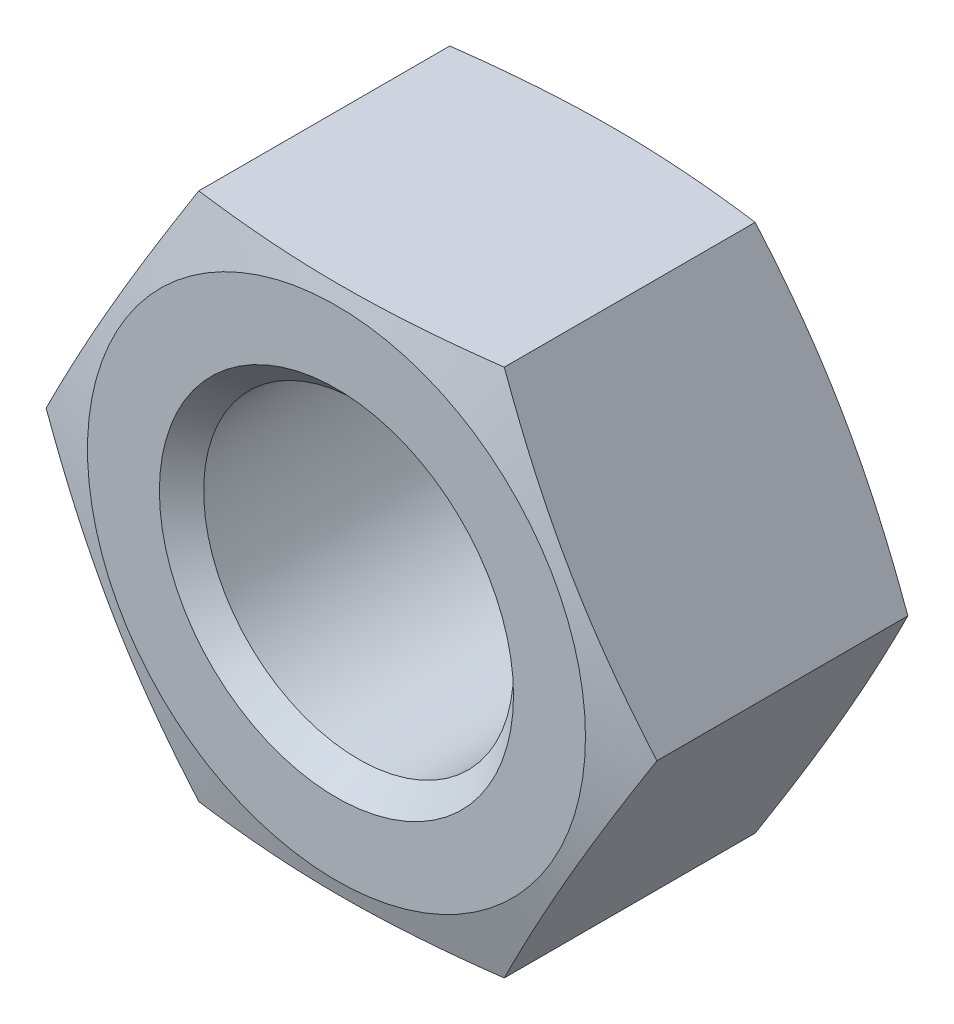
ISO-10303-21;
HEADER;
FILE_DESCRIPTION(('STEP AP214'),'2;1');
FILE_NAME('part.step','',(''),(''),'','','');
FILE_SCHEMA(('AUTOMOTIVE_DESIGN { 1 0 10303 214 1 1 1 1 }'));
ENDSEC;
DATA;
#1=APPLICATION_CONTEXT('core data for automotive mechanical design processes');
#2=APPLICATION_PROTOCOL_DEFINITION('international standard','automotive_design',2000,#1);
#3=PRODUCT_CONTEXT('',#1,'mechanical');
#4=PRODUCT('Part','Part','',(#3));
#5=PRODUCT_RELATED_PRODUCT_CATEGORY('part','',(#4));
#6=PRODUCT_DEFINITION_FORMATION('','',#4);
#7=PRODUCT_DEFINITION_CONTEXT('part definition',#1,'design');
#8=PRODUCT_DEFINITION('design','',#6,#7);
#9=PRODUCT_DEFINITION_SHAPE('','',#8);
#10=(LENGTH_UNIT() NAMED_UNIT(*) SI_UNIT(.MILLI.,.METRE.));
#11=(NAMED_UNIT(*) PLANE_ANGLE_UNIT() SI_UNIT($,.RADIAN.));
#12=(NAMED_UNIT(*) SI_UNIT($,.STERADIAN.) SOLID_ANGLE_UNIT());
#13=UNCERTAINTY_MEASURE_WITH_UNIT(LENGTH_MEASURE(1.E-05),#10,'distance_accuracy_value','');
#14=(GEOMETRIC_REPRESENTATION_CONTEXT(3) GLOBAL_UNCERTAINTY_ASSIGNED_CONTEXT((#13)) GLOBAL_UNIT_ASSIGNED_CONTEXT((#10,
#11,#12)) REPRESENTATION_CONTEXT('',''));
#15=CARTESIAN_POINT('',(0.,0.,0.));
#16=DIRECTION('',(0.,0.,1.));
#17=DIRECTION('',(1.,0.,0.));
#18=AXIS2_PLACEMENT_3D('',#15,#16,#17);
#19=CARTESIAN_POINT('',(-6.89933571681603,-11.95,6.35));
#20=DIRECTION('',(0.,1.,0.));
#21=DIRECTION('',(-1.,0.,0.));
#22=AXIS2_PLACEMENT_3D('',#19,#20,#21);
#23=PLANE('',#22);
#24=CARTESIAN_POINT('',(-18.4038265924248,-11.95,-3.48476992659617));
#25=CARTESIAN_POINT('',(-17.8595542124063,-11.95,-3.60705175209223));
#26=CARTESIAN_POINT('',(-17.3149453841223,-11.95,-3.72786248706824));
#27=CARTESIAN_POINT('',(-16.2248890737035,-11.95,-3.96574669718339));
#28=CARTESIAN_POINT('',(-15.6794415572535,-11.95,-4.0828200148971));
#29=CARTESIAN_POINT('',(-14.5870939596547,-11.95,-4.31252775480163));
#30=CARTESIAN_POINT('',(-14.0401930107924,-11.95,-4.42515806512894));
#31=CARTESIAN_POINT('',(-12.9452627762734,-11.95,-4.64479070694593));
#32=CARTESIAN_POINT('',(-12.3972334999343,-11.95,-4.75179308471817));
#33=CARTESIAN_POINT('',(-11.3049453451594,-11.95,-4.95786340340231));
#34=CARTESIAN_POINT('',(-10.7606986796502,-11.95,-5.05699576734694));
#35=CARTESIAN_POINT('',(-9.6707163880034,-11.95,-5.24677519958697));
#36=CARTESIAN_POINT('',(-9.12498075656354,-11.95,-5.33742223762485));
#37=CARTESIAN_POINT('',(-8.03190097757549,-11.95,-5.50822275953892));
#38=CARTESIAN_POINT('',(-7.48455696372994,-11.95,-5.58837709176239));
#39=CARTESIAN_POINT('',(-6.38812355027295,-11.95,-5.73585875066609));
#40=CARTESIAN_POINT('',(-5.83903414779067,-11.95,-5.80318605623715));
#41=CARTESIAN_POINT('',(-4.73278447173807,-11.95,-5.92315135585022));
#42=CARTESIAN_POINT('',(-4.17560445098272,-11.95,-5.97560993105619));
#43=CARTESIAN_POINT('',(-3.05981190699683,-11.95,-6.06223176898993));
#44=CARTESIAN_POINT('',(-2.50119941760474,-11.95,-6.09639545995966));
#45=CARTESIAN_POINT('',(-1.3833877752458,-11.95,-6.1444379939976));
#46=CARTESIAN_POINT('',(-0.824189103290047,-11.95,-6.15832780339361));
#47=CARTESIAN_POINT('',(0.294335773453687,-11.95,-6.16496976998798));
#48=CARTESIAN_POINT('',(0.853661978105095,-11.95,-6.1577219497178));
#49=CARTESIAN_POINT('',(1.97435005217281,-11.95,-6.12247317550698));
#50=CARTESIAN_POINT('',(2.53570871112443,-11.95,-6.09437218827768));
#51=CARTESIAN_POINT('',(3.65712625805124,-11.95,-6.01900843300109));
#52=CARTESIAN_POINT('',(4.21718511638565,-11.95,-5.97174523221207));
#53=CARTESIAN_POINT('',(5.33603429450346,-11.95,-5.86048247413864));
#54=CARTESIAN_POINT('',(5.8948233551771,-11.95,-5.7964704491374));
#55=CARTESIAN_POINT('',(7.01058859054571,-11.95,-5.65442236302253));
#56=CARTESIAN_POINT('',(7.56756477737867,-11.95,-5.57638639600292));
#57=CARTESIAN_POINT('',(8.83709082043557,-11.95,-5.3851527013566));
#58=CARTESIAN_POINT('',(9.54907919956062,-11.95,-5.26825295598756));
#59=CARTESIAN_POINT('',(10.9705735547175,-11.95,-5.02013562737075));
#60=CARTESIAN_POINT('',(11.6800793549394,-11.95,-4.88891705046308));
#61=CARTESIAN_POINT('',(13.0971625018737,-11.95,-4.61562892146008));
#62=CARTESIAN_POINT('',(13.8047393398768,-11.95,-4.47355674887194));
#63=CARTESIAN_POINT('',(15.2181660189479,-11.95,-4.18119780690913));
#64=CARTESIAN_POINT('',(15.9240159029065,-11.95,-4.03091124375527));
#65=CARTESIAN_POINT('',(17.3348173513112,-11.95,-3.7239295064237));
#66=CARTESIAN_POINT('',(18.0397679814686,-11.95,-3.56723005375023));
#67=CARTESIAN_POINT('',(19.4485617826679,-11.95,-3.24892730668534));
#68=CARTESIAN_POINT('',(20.1524049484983,-11.95,-3.0873239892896));
#69=CARTESIAN_POINT('',(21.5590916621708,-11.95,-2.7602841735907));
#70=CARTESIAN_POINT('',(22.2619353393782,-11.95,-2.59484823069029));
#71=CARTESIAN_POINT('',(23.666888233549,-11.95,-2.26089721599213));
#72=CARTESIAN_POINT('',(24.3689974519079,-11.95,-2.09238215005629));
#73=CARTESIAN_POINT('',(26.4503551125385,-11.95,-1.58896361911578));
#74=CARTESIAN_POINT('',(27.8287496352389,-11.95,-1.25053129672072));
#75=CARTESIAN_POINT('',(30.583999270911,-11.95,-0.567230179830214));
#76=CARTESIAN_POINT('',(31.9608543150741,-11.95,-0.222361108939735));
#77=CARTESIAN_POINT('',(34.7106309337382,-11.95,0.471225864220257));
#78=CARTESIAN_POINT('',(36.0835548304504,-11.95,0.819934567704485));
#79=CARTESIAN_POINT('',(38.1422692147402,-11.95,1.3454713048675));
#80=CARTESIAN_POINT('',(38.8283772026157,-11.95,1.52105779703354));
#81=CARTESIAN_POINT('',(40.2004075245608,-11.95,1.87295279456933));
#82=CARTESIAN_POINT('',(40.8863298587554,-11.95,2.04926129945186));
#83=CARTESIAN_POINT('',(41.572172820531,-11.95,2.22587814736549));
#84=B_SPLINE_CURVE_WITH_KNOTS('',3,(#24,#25,#26,#27,#28,#29,#30,#31,#32,#33,#34,#35,#36,#37,#38,
#39,#40,#41,#42,#43,#44,#45,#46,#47,#48,#49,#50,#51,#52,#53,#54,#55,#56,#57,#58,#59,#60,#61,#62,
#63,#64,#65,#66,#67,#68,#69,#70,#71,#72,#73,#74,#75,#76,#77,#78,#79,#80,#81,#82,#83),
.UNSPECIFIED.,.F.,.F.,(4,2,2,2,2,2,2,2,2,2,2,2,2,2,2,2,2,2,2,2,2,2,2,2,2,2,2,2,2,4),(0.,
1.67352610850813,3.34712261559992,5.02223328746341,6.69733018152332,8.35688039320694,
10.0164365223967,11.675858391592,13.3352829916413,15.0139531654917,16.6925840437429,
18.3703065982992,20.0480273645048,21.7338486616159,23.4197080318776,25.1068259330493,
26.7939325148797,28.9582911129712,31.1228000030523,33.2878331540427,35.4528119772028,
37.6192595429,39.7857172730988,41.9518629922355,44.1180045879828,48.3759786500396,
52.63413597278,56.8836780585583,59.0083361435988,61.1329927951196),.UNSPECIFIED.);
#85=CARTESIAN_POINT('',(6.89933571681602,-11.95,-5.66708554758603));
#86=VERTEX_POINT('',#85);
#87=CARTESIAN_POINT('',(-6.89933571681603,-11.95,-5.66708554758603));
#88=VERTEX_POINT('',#87);
#89=EDGE_CURVE('E54',#86,#88,#84,.F.);
#90=ORIENTED_EDGE('',*,*,#89,.F.);
#91=DIRECTION('',(0.,0.,-1.));
#92=VECTOR('',#91,1.);
#93=CARTESIAN_POINT('',(6.89933571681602,-11.95,6.35));
#94=LINE('',#93,#92);
#95=CARTESIAN_POINT('',(6.89933571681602,-11.95,5.66708554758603));
#96=VERTEX_POINT('',#95);
#97=EDGE_CURVE('E124',#96,#86,#94,.T.);
#98=ORIENTED_EDGE('',*,*,#97,.F.);
#99=CARTESIAN_POINT('',(-18.4038265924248,-11.95,3.48476992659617));
#100=CARTESIAN_POINT('',(-17.8595542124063,-11.95,3.60705175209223));
#101=CARTESIAN_POINT('',(-17.3149453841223,-11.95,3.72786248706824));
#102=CARTESIAN_POINT('',(-16.2248890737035,-11.95,3.96574669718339));
#103=CARTESIAN_POINT('',(-15.6794415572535,-11.95,4.0828200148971));
#104=CARTESIAN_POINT('',(-14.5870939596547,-11.95,4.31252775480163));
#105=CARTESIAN_POINT('',(-14.0401930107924,-11.95,4.42515806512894));
#106=CARTESIAN_POINT('',(-12.9452627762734,-11.95,4.64479070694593));
#107=CARTESIAN_POINT('',(-12.3972334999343,-11.95,4.75179308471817));
#108=CARTESIAN_POINT('',(-11.3049453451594,-11.95,4.95786340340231));
#109=CARTESIAN_POINT('',(-10.7606986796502,-11.95,5.05699576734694));
#110=CARTESIAN_POINT('',(-9.6707163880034,-11.95,5.24677519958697));
#111=CARTESIAN_POINT('',(-9.12498075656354,-11.95,5.33742223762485));
#112=CARTESIAN_POINT('',(-8.03190097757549,-11.95,5.50822275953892));
#113=CARTESIAN_POINT('',(-7.48455696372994,-11.95,5.58837709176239));
#114=CARTESIAN_POINT('',(-6.38812355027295,-11.95,5.73585875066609));
#115=CARTESIAN_POINT('',(-5.83903414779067,-11.95,5.80318605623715));
#116=CARTESIAN_POINT('',(-4.73278447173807,-11.95,5.92315135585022));
#117=CARTESIAN_POINT('',(-4.17560445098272,-11.95,5.97560993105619));
#118=CARTESIAN_POINT('',(-3.05981190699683,-11.95,6.06223176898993));
#119=CARTESIAN_POINT('',(-2.50119941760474,-11.95,6.09639545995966));
#120=CARTESIAN_POINT('',(-1.3833877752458,-11.95,6.1444379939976));
#121=CARTESIAN_POINT('',(-0.824189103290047,-11.95,6.15832780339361));
#122=CARTESIAN_POINT('',(0.294335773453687,-11.95,6.16496976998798));
#123=CARTESIAN_POINT('',(0.853661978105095,-11.95,6.1577219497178));
#124=CARTESIAN_POINT('',(1.97435005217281,-11.95,6.12247317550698));
#125=CARTESIAN_POINT('',(2.53570871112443,-11.95,6.09437218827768));
#126=CARTESIAN_POINT('',(3.65712625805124,-11.95,6.01900843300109));
#127=CARTESIAN_POINT('',(4.21718511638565,-11.95,5.97174523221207));
#128=CARTESIAN_POINT('',(5.33603429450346,-11.95,5.86048247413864));
#129=CARTESIAN_POINT('',(5.8948233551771,-11.95,5.7964704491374));
#130=CARTESIAN_POINT('',(7.01058859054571,-11.95,5.65442236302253));
#131=CARTESIAN_POINT('',(7.56756477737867,-11.95,5.57638639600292));
#132=CARTESIAN_POINT('',(8.83709082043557,-11.95,5.3851527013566));
#133=CARTESIAN_POINT('',(9.54907919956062,-11.95,5.26825295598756));
#134=CARTESIAN_POINT('',(10.9705735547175,-11.95,5.02013562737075));
#135=CARTESIAN_POINT('',(11.6800793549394,-11.95,4.88891705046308));
#136=CARTESIAN_POINT('',(13.0971625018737,-11.95,4.61562892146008));
#137=CARTESIAN_POINT('',(13.8047393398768,-11.95,4.47355674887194));
#138=CARTESIAN_POINT('',(15.2181660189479,-11.95,4.18119780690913));
#139=CARTESIAN_POINT('',(15.9240159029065,-11.95,4.03091124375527));
#140=CARTESIAN_POINT('',(17.3348173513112,-11.95,3.7239295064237));
#141=CARTESIAN_POINT('',(18.0397679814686,-11.95,3.56723005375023));
#142=CARTESIAN_POINT('',(19.4485617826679,-11.95,3.24892730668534));
#143=CARTESIAN_POINT('',(20.1524049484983,-11.95,3.0873239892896));
#144=CARTESIAN_POINT('',(21.5590916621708,-11.95,2.7602841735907));
#145=CARTESIAN_POINT('',(22.2619353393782,-11.95,2.59484823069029));
#146=CARTESIAN_POINT('',(23.666888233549,-11.95,2.26089721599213));
#147=CARTESIAN_POINT('',(24.3689974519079,-11.95,2.09238215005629));
#148=CARTESIAN_POINT('',(26.4503551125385,-11.95,1.58896361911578));
#149=CARTESIAN_POINT('',(27.8287496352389,-11.95,1.25053129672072));
#150=CARTESIAN_POINT('',(30.583999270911,-11.95,0.567230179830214));
#151=CARTESIAN_POINT('',(31.9608543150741,-11.95,0.222361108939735));
#152=CARTESIAN_POINT('',(34.7106309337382,-11.95,-0.471225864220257));
#153=CARTESIAN_POINT('',(36.0835548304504,-11.95,-0.819934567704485));
#154=CARTESIAN_POINT('',(38.1422692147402,-11.95,-1.3454713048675));
#155=CARTESIAN_POINT('',(38.8283772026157,-11.95,-1.52105779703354));
#156=CARTESIAN_POINT('',(40.2004075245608,-11.95,-1.87295279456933));
#157=CARTESIAN_POINT('',(40.8863298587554,-11.95,-2.04926129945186));
#158=CARTESIAN_POINT('',(41.572172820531,-11.95,-2.22587814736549));
#159=B_SPLINE_CURVE_WITH_KNOTS('',3,(#99,#100,#101,#102,#103,#104,#105,#106,#107,#108,#109,#110,
#111,#112,#113,#114,#115,#116,#117,#118,#119,#120,#121,#122,#123,#124,#125,#126,#127,#128,#129,
#130,#131,#132,#133,#134,#135,#136,#137,#138,#139,#140,#141,#142,#143,#144,#145,#146,#147,#148,
#149,#150,#151,#152,#153,#154,#155,#156,#157,#158),.UNSPECIFIED.,.F.,.F.,(4,2,2,2,2,2,2,2,2,2,2,
2,2,2,2,2,2,2,2,2,2,2,2,2,2,2,2,2,2,4),(0.,1.67352610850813,3.34712261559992,5.02223328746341,
6.69733018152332,8.35688039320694,10.0164365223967,11.675858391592,13.3352829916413,
15.0139531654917,16.6925840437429,18.3703065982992,20.0480273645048,21.7338486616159,
23.4197080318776,25.1068259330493,26.7939325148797,28.9582911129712,31.1228000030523,
33.2878331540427,35.4528119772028,37.6192595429,39.7857172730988,41.9518629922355,
44.1180045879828,48.3759786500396,52.63413597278,56.8836780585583,59.0083361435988,
61.1329927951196),.UNSPECIFIED.);
#160=CARTESIAN_POINT('',(-6.89933571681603,-11.95,5.66708554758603));
#161=VERTEX_POINT('',#160);
#162=EDGE_CURVE('E115',#161,#96,#159,.T.);
#163=ORIENTED_EDGE('',*,*,#162,.F.);
#164=DIRECTION('',(0.,0.,-1.));
#165=VECTOR('',#164,1.);
#166=CARTESIAN_POINT('',(-6.89933571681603,-11.95,6.35));
#167=LINE('',#166,#165);
#168=EDGE_CURVE('E111',#161,#88,#167,.T.);
#169=ORIENTED_EDGE('',*,*,#168,.T.);
#170=EDGE_LOOP('',(#90,#98,#163,#169));
#171=FACE_BOUND('',#170,.T.);
#172=ADVANCED_FACE('F39',(#171),#23,.F.);
#173=CARTESIAN_POINT('',(6.89933571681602,-11.95,6.35));
#174=DIRECTION('',(-0.866025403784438,0.5,0.));
#175=DIRECTION('',(-0.5,-0.866025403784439,0.));
#176=AXIS2_PLACEMENT_3D('',#173,#174,#175);
#177=PLANE('',#176);
#178=CARTESIAN_POINT('',(13.7987869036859,0.000199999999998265,-5.66705460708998));
#179=CARTESIAN_POINT('',(13.5122652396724,-0.496070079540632,-5.74385883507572));
#180=CARTESIAN_POINT('',(13.2252240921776,-0.993239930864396,-5.81358430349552));
#181=CARTESIAN_POINT('',(12.6501281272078,-1.98933536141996,-5.93608529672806));
#182=CARTESIAN_POINT('',(12.3620729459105,-2.48826157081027,-5.98885393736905));
#183=CARTESIAN_POINT('',(11.7866953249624,-3.4848448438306,-6.07436078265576));
#184=CARTESIAN_POINT('',(11.4993767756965,-3.98249516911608,-6.10720095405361));
#185=CARTESIAN_POINT('',(10.9243732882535,-4.97843042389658,-6.15123625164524));
#186=CARTESIAN_POINT('',(10.6366884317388,-5.47671521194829,-6.16243556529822));
#187=CARTESIAN_POINT('',(10.0613187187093,-6.47328478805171,-6.16243556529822));
#188=CARTESIAN_POINT('',(9.77363386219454,-6.97156957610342,-6.15123625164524));
#189=CARTESIAN_POINT('',(9.19863037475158,-7.96750483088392,-6.10720095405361));
#190=CARTESIAN_POINT('',(8.9113118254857,-8.4651551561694,-6.07436078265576));
#191=CARTESIAN_POINT('',(8.33593420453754,-9.46173842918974,-5.98885393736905));
#192=CARTESIAN_POINT('',(8.04787902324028,-9.96066463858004,-5.93608529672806));
#193=CARTESIAN_POINT('',(7.47278305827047,-10.9567600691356,-5.81358430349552));
#194=CARTESIAN_POINT('',(7.18574191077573,-11.4539299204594,-5.74385883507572));
#195=CARTESIAN_POINT('',(6.89922024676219,-11.9502,-5.66705460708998));
#196=B_SPLINE_CURVE_WITH_KNOTS('',3,(#178,#179,#180,#181,#182,#183,#184,#185,#186,#187,#188,
#189,#190,#191,#192,#193,#194,#195),.UNSPECIFIED.,.F.,.F.,(4,2,2,2,2,2,2,2,4),(0.,
1.73459307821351,3.46988948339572,5.19623045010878,6.92223734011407,8.64824423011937,
10.3745851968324,12.1098816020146,13.8444746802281),.UNSPECIFIED.);
#197=CARTESIAN_POINT('',(13.7986714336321,0.,-5.66708554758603));
#198=VERTEX_POINT('',#197);
#199=EDGE_CURVE('E199',#198,#86,#196,.T.);
#200=ORIENTED_EDGE('',*,*,#199,.F.);
#201=DIRECTION('',(0.,0.,-1.));
#202=VECTOR('',#201,1.);
#203=CARTESIAN_POINT('',(13.7986714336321,0.,6.35));
#204=LINE('',#203,#202);
#205=CARTESIAN_POINT('',(13.7986714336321,0.,5.66708554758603));
#206=VERTEX_POINT('',#205);
#207=EDGE_CURVE('E121',#206,#198,#204,.T.);
#208=ORIENTED_EDGE('',*,*,#207,.F.);
#209=CARTESIAN_POINT('',(6.89922024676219,-11.9502,5.66705460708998));
#210=CARTESIAN_POINT('',(7.18574191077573,-11.4539299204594,5.74385883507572));
#211=CARTESIAN_POINT('',(7.47278305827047,-10.9567600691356,5.81358430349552));
#212=CARTESIAN_POINT('',(8.04787902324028,-9.96066463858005,5.93608529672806));
#213=CARTESIAN_POINT('',(8.33593420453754,-9.46173842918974,5.98885393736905));
#214=CARTESIAN_POINT('',(8.9113118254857,-8.4651551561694,6.07436078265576));
#215=CARTESIAN_POINT('',(9.19863037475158,-7.96750483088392,6.10720095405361));
#216=CARTESIAN_POINT('',(9.77363386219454,-6.97156957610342,6.15123625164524));
#217=CARTESIAN_POINT('',(10.0613187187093,-6.47328478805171,6.16243556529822));
#218=CARTESIAN_POINT('',(10.6366884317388,-5.47671521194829,6.16243556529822));
#219=CARTESIAN_POINT('',(10.9243732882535,-4.97843042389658,6.15123625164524));
#220=CARTESIAN_POINT('',(11.4993767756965,-3.98249516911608,6.10720095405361));
#221=CARTESIAN_POINT('',(11.7866953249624,-3.4848448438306,6.07436078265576));
#222=CARTESIAN_POINT('',(12.3620729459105,-2.48826157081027,5.98885393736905));
#223=CARTESIAN_POINT('',(12.6501281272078,-1.98933536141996,5.93608529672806));
#224=CARTESIAN_POINT('',(13.2252240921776,-0.993239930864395,5.81358430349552));
#225=CARTESIAN_POINT('',(13.5122652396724,-0.49607007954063,5.74385883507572));
#226=CARTESIAN_POINT('',(13.7987869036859,0.00019999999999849,5.66705460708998));
#227=B_SPLINE_CURVE_WITH_KNOTS('',3,(#209,#210,#211,#212,#213,#214,#215,#216,#217,#218,#219,
#220,#221,#222,#223,#224,#225,#226),.UNSPECIFIED.,.F.,.F.,(4,2,2,2,2,2,2,2,4),(0.,
1.7345930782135,3.46988948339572,5.19623045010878,6.92223734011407,8.64824423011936,
10.3745851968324,12.1098816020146,13.8444746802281),.UNSPECIFIED.);
#228=EDGE_CURVE('E220',#96,#206,#227,.T.);
#229=ORIENTED_EDGE('',*,*,#228,.F.);
#230=ORIENTED_EDGE('',*,*,#97,.T.);
#231=EDGE_LOOP('',(#200,#208,#229,#230));
#232=FACE_BOUND('',#231,.T.);
#233=ADVANCED_FACE('F208',(#232),#177,.F.);
#234=CARTESIAN_POINT('',(13.7986714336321,0.,6.35));
#235=DIRECTION('',(-0.866025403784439,-0.5,0.));
#236=DIRECTION('',(0.5,-0.866025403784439,0.));
#237=AXIS2_PLACEMENT_3D('',#234,#235,#236);
#238=PLANE('',#237);
#239=CARTESIAN_POINT('',(6.89922024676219,11.9502,-5.66705460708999));
#240=CARTESIAN_POINT('',(7.18574191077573,11.4539299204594,-5.74385883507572));
#241=CARTESIAN_POINT('',(7.47278305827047,10.9567600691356,-5.81358430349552));
#242=CARTESIAN_POINT('',(8.04787902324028,9.96066463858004,-5.93608529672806));
#243=CARTESIAN_POINT('',(8.33593420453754,9.46173842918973,-5.98885393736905));
#244=CARTESIAN_POINT('',(8.9113118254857,8.4651551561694,-6.07436078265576));
#245=CARTESIAN_POINT('',(9.19863037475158,7.96750483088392,-6.10720095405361));
#246=CARTESIAN_POINT('',(9.77363386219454,6.97156957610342,-6.15123625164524));
#247=CARTESIAN_POINT('',(10.0613187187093,6.47328478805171,-6.16243556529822));
#248=CARTESIAN_POINT('',(10.6366884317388,5.47671521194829,-6.16243556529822));
#249=CARTESIAN_POINT('',(10.9243732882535,4.97843042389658,-6.15123625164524));
#250=CARTESIAN_POINT('',(11.4993767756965,3.98249516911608,-6.10720095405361));
#251=CARTESIAN_POINT('',(11.7866953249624,3.4848448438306,-6.07436078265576));
#252=CARTESIAN_POINT('',(12.3620729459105,2.48826157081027,-5.98885393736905));
#253=CARTESIAN_POINT('',(12.6501281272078,1.98933536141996,-5.93608529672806));
#254=CARTESIAN_POINT('',(13.2252240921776,0.993239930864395,-5.81358430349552));
#255=CARTESIAN_POINT('',(13.5122652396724,0.496070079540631,-5.74385883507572));
#256=CARTESIAN_POINT('',(13.7987869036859,-0.000199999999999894,-5.66705460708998));
#257=B_SPLINE_CURVE_WITH_KNOTS('',3,(#239,#240,#241,#242,#243,#244,#245,#246,#247,#248,#249,
#250,#251,#252,#253,#254,#255,#256),.UNSPECIFIED.,.F.,.F.,(4,2,2,2,2,2,2,2,4),(0.,
1.73459307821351,3.46988948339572,5.19623045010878,6.92223734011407,8.64824423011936,
10.3745851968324,12.1098816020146,13.8444746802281),.UNSPECIFIED.);
#258=CARTESIAN_POINT('',(6.89933571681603,11.95,-5.66708554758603));
#259=VERTEX_POINT('',#258);
#260=EDGE_CURVE('E194',#259,#198,#257,.T.);
#261=ORIENTED_EDGE('',*,*,#260,.F.);
#262=DIRECTION('',(0.,0.,-1.));
#263=VECTOR('',#262,1.);
#264=CARTESIAN_POINT('',(6.89933571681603,11.95,6.35));
#265=LINE('',#264,#263);
#266=CARTESIAN_POINT('',(6.89933571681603,11.95,5.66708554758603));
#267=VERTEX_POINT('',#266);
#268=EDGE_CURVE('E113',#267,#259,#265,.T.);
#269=ORIENTED_EDGE('',*,*,#268,.F.);
#270=CARTESIAN_POINT('',(13.7987869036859,-0.000200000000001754,5.66705460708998));
#271=CARTESIAN_POINT('',(13.5122652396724,0.496070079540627,5.74385883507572));
#272=CARTESIAN_POINT('',(13.2252240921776,0.993239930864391,5.81358430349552));
#273=CARTESIAN_POINT('',(12.6501281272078,1.98933536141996,5.93608529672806));
#274=CARTESIAN_POINT('',(12.3620729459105,2.48826157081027,5.98885393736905));
#275=CARTESIAN_POINT('',(11.7866953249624,3.4848448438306,6.07436078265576));
#276=CARTESIAN_POINT('',(11.4993767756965,3.98249516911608,6.10720095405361));
#277=CARTESIAN_POINT('',(10.9243732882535,4.97843042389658,6.15123625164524));
#278=CARTESIAN_POINT('',(10.6366884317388,5.47671521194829,6.16243556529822));
#279=CARTESIAN_POINT('',(10.0613187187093,6.47328478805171,6.16243556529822));
#280=CARTESIAN_POINT('',(9.77363386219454,6.97156957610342,6.15123625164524));
#281=CARTESIAN_POINT('',(9.19863037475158,7.96750483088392,6.10720095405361));
#282=CARTESIAN_POINT('',(8.9113118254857,8.4651551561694,6.07436078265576));
#283=CARTESIAN_POINT('',(8.33593420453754,9.46173842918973,5.98885393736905));
#284=CARTESIAN_POINT('',(8.04787902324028,9.96066463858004,5.93608529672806));
#285=CARTESIAN_POINT('',(7.47278305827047,10.9567600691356,5.81358430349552));
#286=CARTESIAN_POINT('',(7.18574191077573,11.4539299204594,5.74385883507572));
#287=CARTESIAN_POINT('',(6.89922024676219,11.9502,5.66705460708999));
#288=B_SPLINE_CURVE_WITH_KNOTS('',3,(#270,#271,#272,#273,#274,#275,#276,#277,#278,#279,#280,
#281,#282,#283,#284,#285,#286,#287),.UNSPECIFIED.,.F.,.F.,(4,2,2,2,2,2,2,2,4),(0.,
1.7345930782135,3.46988948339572,5.19623045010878,6.92223734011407,8.64824423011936,
10.3745851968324,12.1098816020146,13.8444746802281),.UNSPECIFIED.);
#289=EDGE_CURVE('E214',#206,#267,#288,.T.);
#290=ORIENTED_EDGE('',*,*,#289,.F.);
#291=ORIENTED_EDGE('',*,*,#207,.T.);
#292=EDGE_LOOP('',(#261,#269,#290,#291));
#293=FACE_BOUND('',#292,.T.);
#294=ADVANCED_FACE('F204',(#293),#238,.F.);
#295=CARTESIAN_POINT('',(6.89933571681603,11.95,6.35));
#296=DIRECTION('',(0.,-1.,0.));
#297=DIRECTION('',(0.,0.,-1.));
#298=AXIS2_PLACEMENT_3D('',#295,#296,#297);
#299=PLANE('',#298);
#300=CARTESIAN_POINT('',(-18.4038265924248,11.95,-3.48476992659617));
#301=CARTESIAN_POINT('',(-17.8595542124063,11.95,-3.60705175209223));
#302=CARTESIAN_POINT('',(-17.3149453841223,11.95,-3.72786248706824));
#303=CARTESIAN_POINT('',(-16.2248890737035,11.95,-3.96574669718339));
#304=CARTESIAN_POINT('',(-15.6794415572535,11.95,-4.0828200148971));
#305=CARTESIAN_POINT('',(-14.5870939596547,11.95,-4.31252775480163));
#306=CARTESIAN_POINT('',(-14.0401930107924,11.95,-4.42515806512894));
#307=CARTESIAN_POINT('',(-12.9452627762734,11.95,-4.64479070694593));
#308=CARTESIAN_POINT('',(-12.3972334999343,11.95,-4.75179308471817));
#309=CARTESIAN_POINT('',(-11.3049453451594,11.95,-4.95786340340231));
#310=CARTESIAN_POINT('',(-10.7606986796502,11.95,-5.05699576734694));
#311=CARTESIAN_POINT('',(-9.6707163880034,11.95,-5.24677519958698));
#312=CARTESIAN_POINT('',(-9.12498075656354,11.95,-5.33742223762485));
#313=CARTESIAN_POINT('',(-8.03190097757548,11.95,-5.50822275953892));
#314=CARTESIAN_POINT('',(-7.48455696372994,11.95,-5.58837709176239));
#315=CARTESIAN_POINT('',(-6.38812355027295,11.95,-5.73585875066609));
#316=CARTESIAN_POINT('',(-5.83903414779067,11.95,-5.80318605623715));
#317=CARTESIAN_POINT('',(-4.73278447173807,11.95,-5.92315135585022));
#318=CARTESIAN_POINT('',(-4.17560445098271,11.95,-5.97560993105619));
#319=CARTESIAN_POINT('',(-3.05981190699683,11.95,-6.06223176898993));
#320=CARTESIAN_POINT('',(-2.50119941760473,11.95,-6.09639545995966));
#321=CARTESIAN_POINT('',(-1.38338777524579,11.95,-6.1444379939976));
#322=CARTESIAN_POINT('',(-0.824189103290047,11.95,-6.15832780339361));
#323=CARTESIAN_POINT('',(0.294335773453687,11.95,-6.16496976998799));
#324=CARTESIAN_POINT('',(0.853661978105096,11.95,-6.1577219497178));
#325=CARTESIAN_POINT('',(1.97435005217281,11.95,-6.12247317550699));
#326=CARTESIAN_POINT('',(2.53570871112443,11.95,-6.09437218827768));
#327=CARTESIAN_POINT('',(3.65712625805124,11.95,-6.01900843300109));
#328=CARTESIAN_POINT('',(4.21718511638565,11.95,-5.97174523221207));
#329=CARTESIAN_POINT('',(5.33603429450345,11.95,-5.86048247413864));
#330=CARTESIAN_POINT('',(5.8948233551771,11.95,-5.79647044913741));
#331=CARTESIAN_POINT('',(7.01058859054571,11.95,-5.65442236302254));
#332=CARTESIAN_POINT('',(7.56756477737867,11.95,-5.57638639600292));
#333=CARTESIAN_POINT('',(8.83709082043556,11.95,-5.3851527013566));
#334=CARTESIAN_POINT('',(9.54907919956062,11.95,-5.26825295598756));
#335=CARTESIAN_POINT('',(10.9705735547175,11.95,-5.02013562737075));
#336=CARTESIAN_POINT('',(11.6800793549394,11.95,-4.88891705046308));
#337=CARTESIAN_POINT('',(13.0971625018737,11.95,-4.61562892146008));
#338=CARTESIAN_POINT('',(13.8047393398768,11.95,-4.47355674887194));
#339=CARTESIAN_POINT('',(15.2181660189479,11.95,-4.18119780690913));
#340=CARTESIAN_POINT('',(15.9240159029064,11.95,-4.03091124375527));
#341=CARTESIAN_POINT('',(17.3348173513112,11.95,-3.7239295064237));
#342=CARTESIAN_POINT('',(18.0397679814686,11.95,-3.56723005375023));
#343=CARTESIAN_POINT('',(19.4485617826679,11.95,-3.24892730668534));
#344=CARTESIAN_POINT('',(20.1524049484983,11.95,-3.0873239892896));
#345=CARTESIAN_POINT('',(21.5590916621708,11.95,-2.7602841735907));
#346=CARTESIAN_POINT('',(22.2619353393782,11.95,-2.59484823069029));
#347=CARTESIAN_POINT('',(23.6668882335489,11.95,-2.26089721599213));
#348=CARTESIAN_POINT('',(24.3689974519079,11.95,-2.09238215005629));
#349=CARTESIAN_POINT('',(26.4503551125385,11.95,-1.58896361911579));
#350=CARTESIAN_POINT('',(27.8287496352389,11.95,-1.25053129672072));
#351=CARTESIAN_POINT('',(30.583999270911,11.95,-0.567230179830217));
#352=CARTESIAN_POINT('',(31.9608543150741,11.95,-0.222361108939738));
#353=CARTESIAN_POINT('',(34.7106309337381,11.95,0.471225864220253));
#354=CARTESIAN_POINT('',(36.0835548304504,11.95,0.819934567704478));
#355=CARTESIAN_POINT('',(38.1422692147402,11.95,1.3454713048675));
#356=CARTESIAN_POINT('',(38.8283772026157,11.95,1.52105779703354));
#357=CARTESIAN_POINT('',(40.2004075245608,11.95,1.87295279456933));
#358=CARTESIAN_POINT('',(40.8863298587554,11.95,2.04926129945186));
#359=CARTESIAN_POINT('',(41.572172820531,11.95,2.22587814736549));
#360=B_SPLINE_CURVE_WITH_KNOTS('',3,(#300,#301,#302,#303,#304,#305,#306,#307,#308,#309,#310,
#311,#312,#313,#314,#315,#316,#317,#318,#319,#320,#321,#322,#323,#324,#325,#326,#327,#328,#329,
#330,#331,#332,#333,#334,#335,#336,#337,#338,#339,#340,#341,#342,#343,#344,#345,#346,#347,#348,
#349,#350,#351,#352,#353,#354,#355,#356,#357,#358,#359),.UNSPECIFIED.,.F.,.F.,(4,2,2,2,2,2,2,2,
2,2,2,2,2,2,2,2,2,2,2,2,2,2,2,2,2,2,2,2,2,4),(0.,1.67352610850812,3.34712261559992,
5.0222332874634,6.69733018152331,8.35688039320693,10.0164365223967,11.675858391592,
13.3352829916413,15.0139531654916,16.6925840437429,18.3703065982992,20.0480273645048,
21.7338486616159,23.4197080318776,25.1068259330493,26.7939325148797,28.9582911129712,
31.1228000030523,33.2878331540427,35.4528119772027,37.6192595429,39.7857172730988,
41.9518629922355,44.1180045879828,48.3759786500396,52.63413597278,56.8836780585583,
59.0083361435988,61.1329927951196),.UNSPECIFIED.);
#361=CARTESIAN_POINT('',(-6.89933571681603,11.95,-5.66708554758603));
#362=VERTEX_POINT('',#361);
#363=EDGE_CURVE('E107',#362,#259,#360,.T.);
#364=ORIENTED_EDGE('',*,*,#363,.F.);
#365=DIRECTION('',(0.,0.,-1.));
#366=VECTOR('',#365,1.);
#367=CARTESIAN_POINT('',(-6.89933571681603,11.95,6.35));
#368=LINE('',#367,#366);
#369=CARTESIAN_POINT('',(-6.89933571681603,11.95,5.66708554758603));
#370=VERTEX_POINT('',#369);
#371=EDGE_CURVE('E106',#370,#362,#368,.T.);
#372=ORIENTED_EDGE('',*,*,#371,.F.);
#373=CARTESIAN_POINT('',(-18.4038265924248,11.95,3.48476992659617));
#374=CARTESIAN_POINT('',(-17.8595542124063,11.95,3.60705175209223));
#375=CARTESIAN_POINT('',(-17.3149453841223,11.95,3.72786248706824));
#376=CARTESIAN_POINT('',(-16.2248890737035,11.95,3.96574669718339));
#377=CARTESIAN_POINT('',(-15.6794415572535,11.95,4.0828200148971));
#378=CARTESIAN_POINT('',(-14.5870939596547,11.95,4.31252775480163));
#379=CARTESIAN_POINT('',(-14.0401930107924,11.95,4.42515806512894));
#380=CARTESIAN_POINT('',(-12.9452627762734,11.95,4.64479070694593));
#381=CARTESIAN_POINT('',(-12.3972334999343,11.95,4.75179308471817));
#382=CARTESIAN_POINT('',(-11.3049453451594,11.95,4.95786340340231));
#383=CARTESIAN_POINT('',(-10.7606986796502,11.95,5.05699576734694));
#384=CARTESIAN_POINT('',(-9.6707163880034,11.95,5.24677519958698));
#385=CARTESIAN_POINT('',(-9.12498075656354,11.95,5.33742223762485));
#386=CARTESIAN_POINT('',(-8.03190097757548,11.95,5.50822275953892));
#387=CARTESIAN_POINT('',(-7.48455696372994,11.95,5.58837709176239));
#388=CARTESIAN_POINT('',(-6.38812355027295,11.95,5.73585875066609));
#389=CARTESIAN_POINT('',(-5.83903414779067,11.95,5.80318605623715));
#390=CARTESIAN_POINT('',(-4.73278447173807,11.95,5.92315135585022));
#391=CARTESIAN_POINT('',(-4.17560445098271,11.95,5.97560993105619));
#392=CARTESIAN_POINT('',(-3.05981190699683,11.95,6.06223176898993));
#393=CARTESIAN_POINT('',(-2.50119941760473,11.95,6.09639545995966));
#394=CARTESIAN_POINT('',(-1.38338777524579,11.95,6.1444379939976));
#395=CARTESIAN_POINT('',(-0.824189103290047,11.95,6.15832780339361));
#396=CARTESIAN_POINT('',(0.294335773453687,11.95,6.16496976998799));
#397=CARTESIAN_POINT('',(0.853661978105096,11.95,6.1577219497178));
#398=CARTESIAN_POINT('',(1.97435005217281,11.95,6.12247317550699));
#399=CARTESIAN_POINT('',(2.53570871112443,11.95,6.09437218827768));
#400=CARTESIAN_POINT('',(3.65712625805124,11.95,6.01900843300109));
#401=CARTESIAN_POINT('',(4.21718511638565,11.95,5.97174523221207));
#402=CARTESIAN_POINT('',(5.33603429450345,11.95,5.86048247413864));
#403=CARTESIAN_POINT('',(5.8948233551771,11.95,5.79647044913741));
#404=CARTESIAN_POINT('',(7.01058859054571,11.95,5.65442236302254));
#405=CARTESIAN_POINT('',(7.56756477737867,11.95,5.57638639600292));
#406=CARTESIAN_POINT('',(8.83709082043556,11.95,5.3851527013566));
#407=CARTESIAN_POINT('',(9.54907919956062,11.95,5.26825295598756));
#408=CARTESIAN_POINT('',(10.9705735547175,11.95,5.02013562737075));
#409=CARTESIAN_POINT('',(11.6800793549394,11.95,4.88891705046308));
#410=CARTESIAN_POINT('',(13.0971625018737,11.95,4.61562892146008));
#411=CARTESIAN_POINT('',(13.8047393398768,11.95,4.47355674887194));
#412=CARTESIAN_POINT('',(15.2181660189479,11.95,4.18119780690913));
#413=CARTESIAN_POINT('',(15.9240159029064,11.95,4.03091124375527));
#414=CARTESIAN_POINT('',(17.3348173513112,11.95,3.7239295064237));
#415=CARTESIAN_POINT('',(18.0397679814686,11.95,3.56723005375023));
#416=CARTESIAN_POINT('',(19.4485617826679,11.95,3.24892730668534));
#417=CARTESIAN_POINT('',(20.1524049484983,11.95,3.0873239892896));
#418=CARTESIAN_POINT('',(21.5590916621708,11.95,2.7602841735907));
#419=CARTESIAN_POINT('',(22.2619353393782,11.95,2.59484823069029));
#420=CARTESIAN_POINT('',(23.6668882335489,11.95,2.26089721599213));
#421=CARTESIAN_POINT('',(24.3689974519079,11.95,2.09238215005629));
#422=CARTESIAN_POINT('',(26.4503551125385,11.95,1.58896361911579));
#423=CARTESIAN_POINT('',(27.8287496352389,11.95,1.25053129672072));
#424=CARTESIAN_POINT('',(30.583999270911,11.95,0.567230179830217));
#425=CARTESIAN_POINT('',(31.9608543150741,11.95,0.222361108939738));
#426=CARTESIAN_POINT('',(34.7106309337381,11.95,-0.471225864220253));
#427=CARTESIAN_POINT('',(36.0835548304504,11.95,-0.819934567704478));
#428=CARTESIAN_POINT('',(38.1422692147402,11.95,-1.3454713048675));
#429=CARTESIAN_POINT('',(38.8283772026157,11.95,-1.52105779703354));
#430=CARTESIAN_POINT('',(40.2004075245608,11.95,-1.87295279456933));
#431=CARTESIAN_POINT('',(40.8863298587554,11.95,-2.04926129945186));
#432=CARTESIAN_POINT('',(41.572172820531,11.95,-2.22587814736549));
#433=B_SPLINE_CURVE_WITH_KNOTS('',3,(#373,#374,#375,#376,#377,#378,#379,#380,#381,#382,#383,
#384,#385,#386,#387,#388,#389,#390,#391,#392,#393,#394,#395,#396,#397,#398,#399,#400,#401,#402,
#403,#404,#405,#406,#407,#408,#409,#410,#411,#412,#413,#414,#415,#416,#417,#418,#419,#420,#421,
#422,#423,#424,#425,#426,#427,#428,#429,#430,#431,#432),.UNSPECIFIED.,.F.,.F.,(4,2,2,2,2,2,2,2,
2,2,2,2,2,2,2,2,2,2,2,2,2,2,2,2,2,2,2,2,2,4),(0.,1.67352610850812,3.34712261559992,
5.0222332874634,6.69733018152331,8.35688039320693,10.0164365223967,11.675858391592,
13.3352829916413,15.0139531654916,16.6925840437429,18.3703065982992,20.0480273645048,
21.7338486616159,23.4197080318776,25.1068259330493,26.7939325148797,28.9582911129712,
31.1228000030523,33.2878331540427,35.4528119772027,37.6192595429,39.7857172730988,
41.9518629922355,44.1180045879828,48.3759786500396,52.63413597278,56.8836780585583,
59.0083361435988,61.1329927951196),.UNSPECIFIED.);
#434=EDGE_CURVE('E221',#267,#370,#433,.F.);
#435=ORIENTED_EDGE('',*,*,#434,.F.);
#436=ORIENTED_EDGE('',*,*,#268,.T.);
#437=EDGE_LOOP('',(#364,#372,#435,#436));
#438=FACE_BOUND('',#437,.T.);
#439=ADVANCED_FACE('F207',(#438),#299,.F.);
#440=CARTESIAN_POINT('',(-6.89933571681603,11.95,6.35));
#441=DIRECTION('',(0.866025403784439,-0.5,0.));
#442=DIRECTION('',(0.5,0.866025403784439,0.));
#443=AXIS2_PLACEMENT_3D('',#440,#441,#442);
#444=PLANE('',#443);
#445=CARTESIAN_POINT('',(-13.7987869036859,-0.0002,-5.66705460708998));
#446=CARTESIAN_POINT('',(-13.5122652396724,0.496070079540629,-5.74385883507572));
#447=CARTESIAN_POINT('',(-13.2252240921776,0.993239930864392,-5.81358430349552));
#448=CARTESIAN_POINT('',(-12.6501281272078,1.98933536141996,-5.93608529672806));
#449=CARTESIAN_POINT('',(-12.3620729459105,2.48826157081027,-5.98885393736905));
#450=CARTESIAN_POINT('',(-11.7866953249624,3.4848448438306,-6.07436078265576));
#451=CARTESIAN_POINT('',(-11.4993767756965,3.98249516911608,-6.10720095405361));
#452=CARTESIAN_POINT('',(-10.9243732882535,4.97843042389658,-6.15123625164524));
#453=CARTESIAN_POINT('',(-10.6366884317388,5.47671521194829,-6.16243556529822));
#454=CARTESIAN_POINT('',(-10.0613187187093,6.47328478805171,-6.16243556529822));
#455=CARTESIAN_POINT('',(-9.77363386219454,6.97156957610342,-6.15123625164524));
#456=CARTESIAN_POINT('',(-9.19863037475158,7.96750483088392,-6.10720095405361));
#457=CARTESIAN_POINT('',(-8.91131182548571,8.4651551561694,-6.07436078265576));
#458=CARTESIAN_POINT('',(-8.33593420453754,9.46173842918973,-5.98885393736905));
#459=CARTESIAN_POINT('',(-8.04787902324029,9.96066463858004,-5.93608529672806));
#460=CARTESIAN_POINT('',(-7.47278305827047,10.9567600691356,-5.81358430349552));
#461=CARTESIAN_POINT('',(-7.18574191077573,11.4539299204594,-5.74385883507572));
#462=CARTESIAN_POINT('',(-6.89922024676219,11.9502,-5.66705460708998));
#463=B_SPLINE_CURVE_WITH_KNOTS('',3,(#445,#446,#447,#448,#449,#450,#451,#452,#453,#454,#455,
#456,#457,#458,#459,#460,#461,#462),.UNSPECIFIED.,.F.,.F.,(4,2,2,2,2,2,2,2,4),(0.,
1.7345930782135,3.46988948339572,5.19623045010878,6.92223734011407,8.64824423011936,
10.3745851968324,12.1098816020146,13.8444746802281),.UNSPECIFIED.);
#464=CARTESIAN_POINT('',(-13.7986714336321,0.,-5.66708554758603));
#465=VERTEX_POINT('',#464);
#466=EDGE_CURVE('E92',#465,#362,#463,.T.);
#467=ORIENTED_EDGE('',*,*,#466,.F.);
#468=DIRECTION('',(0.,0.,-1.));
#469=VECTOR('',#468,1.);
#470=CARTESIAN_POINT('',(-13.7986714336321,0.,6.35));
#471=LINE('',#470,#469);
#472=CARTESIAN_POINT('',(-13.7986714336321,0.,5.66708554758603));
#473=VERTEX_POINT('',#472);
#474=EDGE_CURVE('E104',#473,#465,#471,.T.);
#475=ORIENTED_EDGE('',*,*,#474,.F.);
#476=CARTESIAN_POINT('',(-6.89922024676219,11.9502,5.66705460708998));
#477=CARTESIAN_POINT('',(-7.18574191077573,11.4539299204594,5.74385883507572));
#478=CARTESIAN_POINT('',(-7.47278305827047,10.9567600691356,5.81358430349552));
#479=CARTESIAN_POINT('',(-8.04787902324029,9.96066463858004,5.93608529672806));
#480=CARTESIAN_POINT('',(-8.33593420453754,9.46173842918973,5.98885393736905));
#481=CARTESIAN_POINT('',(-8.91131182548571,8.4651551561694,6.07436078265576));
#482=CARTESIAN_POINT('',(-9.19863037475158,7.96750483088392,6.10720095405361));
#483=CARTESIAN_POINT('',(-9.77363386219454,6.97156957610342,6.15123625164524));
#484=CARTESIAN_POINT('',(-10.0613187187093,6.47328478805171,6.16243556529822));
#485=CARTESIAN_POINT('',(-10.6366884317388,5.47671521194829,6.16243556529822));
#486=CARTESIAN_POINT('',(-10.9243732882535,4.97843042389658,6.15123625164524));
#487=CARTESIAN_POINT('',(-11.4993767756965,3.98249516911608,6.10720095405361));
#488=CARTESIAN_POINT('',(-11.7866953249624,3.4848448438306,6.07436078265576));
#489=CARTESIAN_POINT('',(-12.3620729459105,2.48826157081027,5.98885393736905));
#490=CARTESIAN_POINT('',(-12.6501281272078,1.98933536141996,5.93608529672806));
#491=CARTESIAN_POINT('',(-13.2252240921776,0.993239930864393,5.81358430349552));
#492=CARTESIAN_POINT('',(-13.5122652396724,0.49607007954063,5.74385883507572));
#493=CARTESIAN_POINT('',(-13.7987869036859,-0.000200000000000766,5.66705460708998));
#494=B_SPLINE_CURVE_WITH_KNOTS('',3,(#476,#477,#478,#479,#480,#481,#482,#483,#484,#485,#486,
#487,#488,#489,#490,#491,#492,#493),.UNSPECIFIED.,.F.,.F.,(4,2,2,2,2,2,2,2,4),(0.,
1.73459307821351,3.46988948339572,5.19623045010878,6.92223734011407,8.64824423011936,
10.3745851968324,12.1098816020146,13.8444746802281),.UNSPECIFIED.);
#495=EDGE_CURVE('E62',#370,#473,#494,.T.);
#496=ORIENTED_EDGE('',*,*,#495,.F.);
#497=ORIENTED_EDGE('',*,*,#371,.T.);
#498=EDGE_LOOP('',(#467,#475,#496,#497));
#499=FACE_BOUND('',#498,.T.);
#500=ADVANCED_FACE('F103',(#499),#444,.F.);
#501=CARTESIAN_POINT('',(-13.7986714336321,0.,6.35));
#502=DIRECTION('',(0.866025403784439,0.5,0.));
#503=DIRECTION('',(-0.5,0.866025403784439,0.));
#504=AXIS2_PLACEMENT_3D('',#501,#502,#503);
#505=PLANE('',#504);
#506=CARTESIAN_POINT('',(-6.89922024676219,-11.9502,-5.66705460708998));
#507=CARTESIAN_POINT('',(-7.18574191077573,-11.4539299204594,-5.74385883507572));
#508=CARTESIAN_POINT('',(-7.47278305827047,-10.9567600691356,-5.81358430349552));
#509=CARTESIAN_POINT('',(-8.04787902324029,-9.96066463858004,-5.93608529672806));
#510=CARTESIAN_POINT('',(-8.33593420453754,-9.46173842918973,-5.98885393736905));
#511=CARTESIAN_POINT('',(-8.91131182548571,-8.4651551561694,-6.07436078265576));
#512=CARTESIAN_POINT('',(-9.19863037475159,-7.96750483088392,-6.10720095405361));
#513=CARTESIAN_POINT('',(-9.77363386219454,-6.97156957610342,-6.15123625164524));
#514=CARTESIAN_POINT('',(-10.0613187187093,-6.47328478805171,-6.16243556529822));
#515=CARTESIAN_POINT('',(-10.6366884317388,-5.47671521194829,-6.16243556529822));
#516=CARTESIAN_POINT('',(-10.9243732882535,-4.97843042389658,-6.15123625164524));
#517=CARTESIAN_POINT('',(-11.4993767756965,-3.98249516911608,-6.10720095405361));
#518=CARTESIAN_POINT('',(-11.7866953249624,-3.4848448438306,-6.07436078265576));
#519=CARTESIAN_POINT('',(-12.3620729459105,-2.48826157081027,-5.98885393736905));
#520=CARTESIAN_POINT('',(-12.6501281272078,-1.98933536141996,-5.93608529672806));
#521=CARTESIAN_POINT('',(-13.2252240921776,-0.993239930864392,-5.81358430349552));
#522=CARTESIAN_POINT('',(-13.5122652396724,-0.496070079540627,-5.74385883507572));
#523=CARTESIAN_POINT('',(-13.7987869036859,0.000200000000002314,-5.66705460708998));
#524=B_SPLINE_CURVE_WITH_KNOTS('',3,(#506,#507,#508,#509,#510,#511,#512,#513,#514,#515,#516,
#517,#518,#519,#520,#521,#522,#523),.UNSPECIFIED.,.F.,.F.,(4,2,2,2,2,2,2,2,4),(0.,
1.7345930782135,3.46988948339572,5.19623045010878,6.92223734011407,8.64824423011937,
10.3745851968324,12.1098816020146,13.8444746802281),.UNSPECIFIED.);
#525=EDGE_CURVE('E89',#88,#465,#524,.T.);
#526=ORIENTED_EDGE('',*,*,#525,.F.);
#527=ORIENTED_EDGE('',*,*,#168,.F.);
#528=CARTESIAN_POINT('',(-13.7987869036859,0.000200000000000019,5.66705460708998));
#529=CARTESIAN_POINT('',(-13.5122652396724,-0.496070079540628,5.74385883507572));
#530=CARTESIAN_POINT('',(-13.2252240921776,-0.993239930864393,5.81358430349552));
#531=CARTESIAN_POINT('',(-12.6501281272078,-1.98933536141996,5.93608529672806));
#532=CARTESIAN_POINT('',(-12.3620729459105,-2.48826157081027,5.98885393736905));
#533=CARTESIAN_POINT('',(-11.7866953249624,-3.4848448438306,6.07436078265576));
#534=CARTESIAN_POINT('',(-11.4993767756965,-3.98249516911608,6.10720095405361));
#535=CARTESIAN_POINT('',(-10.9243732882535,-4.97843042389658,6.15123625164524));
#536=CARTESIAN_POINT('',(-10.6366884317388,-5.47671521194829,6.16243556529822));
#537=CARTESIAN_POINT('',(-10.0613187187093,-6.47328478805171,6.16243556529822));
#538=CARTESIAN_POINT('',(-9.77363386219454,-6.97156957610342,6.15123625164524));
#539=CARTESIAN_POINT('',(-9.19863037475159,-7.96750483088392,6.10720095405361));
#540=CARTESIAN_POINT('',(-8.91131182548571,-8.4651551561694,6.07436078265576));
#541=CARTESIAN_POINT('',(-8.33593420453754,-9.46173842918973,5.98885393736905));
#542=CARTESIAN_POINT('',(-8.04787902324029,-9.96066463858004,5.93608529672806));
#543=CARTESIAN_POINT('',(-7.47278305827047,-10.9567600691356,5.81358430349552));
#544=CARTESIAN_POINT('',(-7.18574191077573,-11.4539299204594,5.74385883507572));
#545=CARTESIAN_POINT('',(-6.89922024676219,-11.9502,5.66705460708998));
#546=B_SPLINE_CURVE_WITH_KNOTS('',3,(#528,#529,#530,#531,#532,#533,#534,#535,#536,#537,#538,
#539,#540,#541,#542,#543,#544,#545),.UNSPECIFIED.,.F.,.F.,(4,2,2,2,2,2,2,2,4),(0.,
1.7345930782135,3.46988948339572,5.19623045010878,6.92223734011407,8.64824423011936,
10.3745851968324,12.1098816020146,13.8444746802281),.UNSPECIFIED.);
#547=EDGE_CURVE('E110',#473,#161,#546,.T.);
#548=ORIENTED_EDGE('',*,*,#547,.F.);
#549=ORIENTED_EDGE('',*,*,#474,.T.);
#550=EDGE_LOOP('',(#526,#527,#548,#549));
#551=FACE_BOUND('',#550,.T.);
#552=ADVANCED_FACE('F109',(#551),#505,.F.);
#553=CARTESIAN_POINT('',(0.,0.,-6.35));
#554=DIRECTION('',(0.,0.,1.));
#555=DIRECTION('',(1.,0.,0.));
#556=AXIS2_PLACEMENT_3D('',#553,#554,#555);
#557=PLANE('',#556);
#558=CARTESIAN_POINT('',(0.,0.,-6.35));
#559=DIRECTION('',(0.,0.,1.));
#560=DIRECTION('',(1.,0.,0.));
#561=AXIS2_PLACEMENT_3D('',#558,#559,#560);
#562=CIRCLE('',#561,7.99999999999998);
#563=CARTESIAN_POINT('',(7.99999999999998,0.,-6.35));
#564=VERTEX_POINT('',#563);
#565=EDGE_CURVE('E12',#564,#564,#562,.T.);
#566=ORIENTED_EDGE('',*,*,#565,.T.);
#567=EDGE_LOOP('',(#566));
#568=FACE_BOUND('',#567,.T.);
#569=CARTESIAN_POINT('',(0.,0.,-6.35));
#570=DIRECTION('',(0.,0.,-1.));
#571=DIRECTION('',(-1.,0.,0.));
#572=AXIS2_PLACEMENT_3D('',#569,#570,#571);
#573=CIRCLE('',#572,11.25);
#574=CARTESIAN_POINT('',(-11.25,0.,-6.35));
#575=VERTEX_POINT('',#574);
#576=EDGE_CURVE('E98',#575,#575,#573,.T.);
#577=ORIENTED_EDGE('',*,*,#576,.T.);
#578=EDGE_LOOP('',(#577));
#579=FACE_BOUND('',#578,.T.);
#580=ADVANCED_FACE('F154',(#568,#579),#557,.F.);
#581=CARTESIAN_POINT('',(0.,0.,6.35));
#582=DIRECTION('',(0.,0.,1.));
#583=DIRECTION('',(1.,0.,0.));
#584=AXIS2_PLACEMENT_3D('',#581,#582,#583);
#585=PLANE('',#584);
#586=CARTESIAN_POINT('',(0.,0.,6.35));
#587=DIRECTION('',(0.,0.,1.));
#588=DIRECTION('',(1.,0.,0.));
#589=AXIS2_PLACEMENT_3D('',#586,#587,#588);
#590=CIRCLE('',#589,8.);
#591=CARTESIAN_POINT('',(8.,0.,6.35));
#592=VERTEX_POINT('',#591);
#593=EDGE_CURVE('E47',#592,#592,#590,.F.);
#594=ORIENTED_EDGE('',*,*,#593,.T.);
#595=EDGE_LOOP('',(#594));
#596=FACE_BOUND('',#595,.T.);
#597=CARTESIAN_POINT('',(0.,0.,6.35));
#598=DIRECTION('',(0.,0.,1.));
#599=DIRECTION('',(1.,0.,0.));
#600=AXIS2_PLACEMENT_3D('',#597,#598,#599);
#601=CIRCLE('',#600,11.25);
#602=CARTESIAN_POINT('',(11.25,0.,6.35));
#603=VERTEX_POINT('',#602);
#604=EDGE_CURVE('E242',#603,#603,#601,.T.);
#605=ORIENTED_EDGE('',*,*,#604,.T.);
#606=EDGE_LOOP('',(#605));
#607=FACE_BOUND('',#606,.T.);
#608=ADVANCED_FACE('F135',(#596,#607),#585,.T.);
#609=CARTESIAN_POINT('',(0.,0.,6.35));
#610=DIRECTION('',(0.,0.,1.));
#611=DIRECTION('',(1.,0.,0.));
#612=AXIS2_PLACEMENT_3D('',#609,#610,#611);
#613=CYLINDRICAL_SURFACE('',#612,6.99999999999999);
#614=CARTESIAN_POINT('',(0.,0.,5.35));
#615=DIRECTION('',(0.,0.,1.));
#616=DIRECTION('',(1.,0.,0.));
#617=AXIS2_PLACEMENT_3D('',#614,#615,#616);
#618=CIRCLE('',#617,6.99999999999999);
#619=CARTESIAN_POINT('',(6.99999999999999,0.,5.35));
#620=VERTEX_POINT('',#619);
#621=EDGE_CURVE('E130',#620,#620,#618,.T.);
#622=ORIENTED_EDGE('',*,*,#621,.T.);
#623=EDGE_LOOP('',(#622));
#624=FACE_BOUND('',#623,.T.);
#625=CARTESIAN_POINT('',(0.,0.,-5.35));
#626=DIRECTION('',(0.,0.,1.));
#627=DIRECTION('',(1.,0.,0.));
#628=AXIS2_PLACEMENT_3D('',#625,#626,#627);
#629=CIRCLE('',#628,6.99999999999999);
#630=CARTESIAN_POINT('',(6.99999999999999,0.,-5.35));
#631=VERTEX_POINT('',#630);
#632=EDGE_CURVE('E127',#631,#631,#629,.F.);
#633=ORIENTED_EDGE('',*,*,#632,.T.);
#634=EDGE_LOOP('',(#633));
#635=FACE_BOUND('',#634,.T.);
#636=ADVANCED_FACE('F143',(#624,#635),#613,.F.);
#637=CARTESIAN_POINT('',(0.,0.,6.35));
#638=DIRECTION('',(0.,0.,-1.));
#639=DIRECTION('',(1.,0.,0.));
#640=AXIS2_PLACEMENT_3D('',#637,#638,#639);
#641=CONICAL_SURFACE('',#640,11.25,1.30899693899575);
#642=ORIENTED_EDGE('',*,*,#604,.F.);
#643=EDGE_LOOP('',(#642));
#644=FACE_BOUND('',#643,.T.);
#645=ORIENTED_EDGE('',*,*,#162,.T.);
#646=ORIENTED_EDGE('',*,*,#228,.T.);
#647=ORIENTED_EDGE('',*,*,#289,.T.);
#648=ORIENTED_EDGE('',*,*,#434,.T.);
#649=ORIENTED_EDGE('',*,*,#495,.T.);
#650=ORIENTED_EDGE('',*,*,#547,.T.);
#651=EDGE_LOOP('',(#645,#646,#647,#648,#649,#650));
#652=FACE_BOUND('',#651,.T.);
#653=ADVANCED_FACE('F146',(#644,#652),#641,.T.);
#654=CARTESIAN_POINT('',(0.,0.,-6.35));
#655=DIRECTION('',(0.,0.,1.));
#656=DIRECTION('',(-1.,0.,0.));
#657=AXIS2_PLACEMENT_3D('',#654,#655,#656);
#658=CONICAL_SURFACE('',#657,11.25,1.30899693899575);
#659=ORIENTED_EDGE('',*,*,#576,.F.);
#660=EDGE_LOOP('',(#659));
#661=FACE_BOUND('',#660,.T.);
#662=ORIENTED_EDGE('',*,*,#89,.T.);
#663=ORIENTED_EDGE('',*,*,#525,.T.);
#664=ORIENTED_EDGE('',*,*,#466,.T.);
#665=ORIENTED_EDGE('',*,*,#363,.T.);
#666=ORIENTED_EDGE('',*,*,#260,.T.);
#667=ORIENTED_EDGE('',*,*,#199,.T.);
#668=EDGE_LOOP('',(#662,#663,#664,#665,#666,#667));
#669=FACE_BOUND('',#668,.T.);
#670=ADVANCED_FACE('F91',(#661,#669),#658,.T.);
#671=CARTESIAN_POINT('',(0.,0.,5.35));
#672=DIRECTION('',(0.,0.,1.));
#673=DIRECTION('',(1.,0.,0.));
#674=AXIS2_PLACEMENT_3D('',#671,#672,#673);
#675=CONICAL_SURFACE('',#674,6.99999999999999,0.785398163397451);
#676=ORIENTED_EDGE('',*,*,#593,.F.);
#677=EDGE_LOOP('',(#676));
#678=FACE_BOUND('',#677,.T.);
#679=ORIENTED_EDGE('',*,*,#621,.F.);
#680=EDGE_LOOP('',(#679));
#681=FACE_BOUND('',#680,.T.);
#682=ADVANCED_FACE('F138',(#678,#681),#675,.F.);
#683=CARTESIAN_POINT('',(0.,0.,-6.35));
#684=DIRECTION('',(0.,0.,-1.));
#685=DIRECTION('',(-1.,0.,0.));
#686=AXIS2_PLACEMENT_3D('',#683,#684,#685);
#687=CONICAL_SURFACE('',#686,7.99999999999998,0.785398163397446);
#688=ORIENTED_EDGE('',*,*,#632,.F.);
#689=EDGE_LOOP('',(#688));
#690=FACE_BOUND('',#689,.T.);
#691=ORIENTED_EDGE('',*,*,#565,.F.);
#692=EDGE_LOOP('',(#691));
#693=FACE_BOUND('',#692,.T.);
#694=ADVANCED_FACE('F41',(#690,#693),#687,.F.);
#695=CLOSED_SHELL('',(#172,#233,#294,#439,#500,#552,#580,#608,#636,#653,#670,#682,#694));
#696=MANIFOLD_SOLID_BREP('B2',#695);
#697=ADVANCED_BREP_SHAPE_REPRESENTATION('',(#18,#696),#14);
#698=SHAPE_DEFINITION_REPRESENTATION(#9,#697);
ENDSEC;
END-ISO-10303-21;
